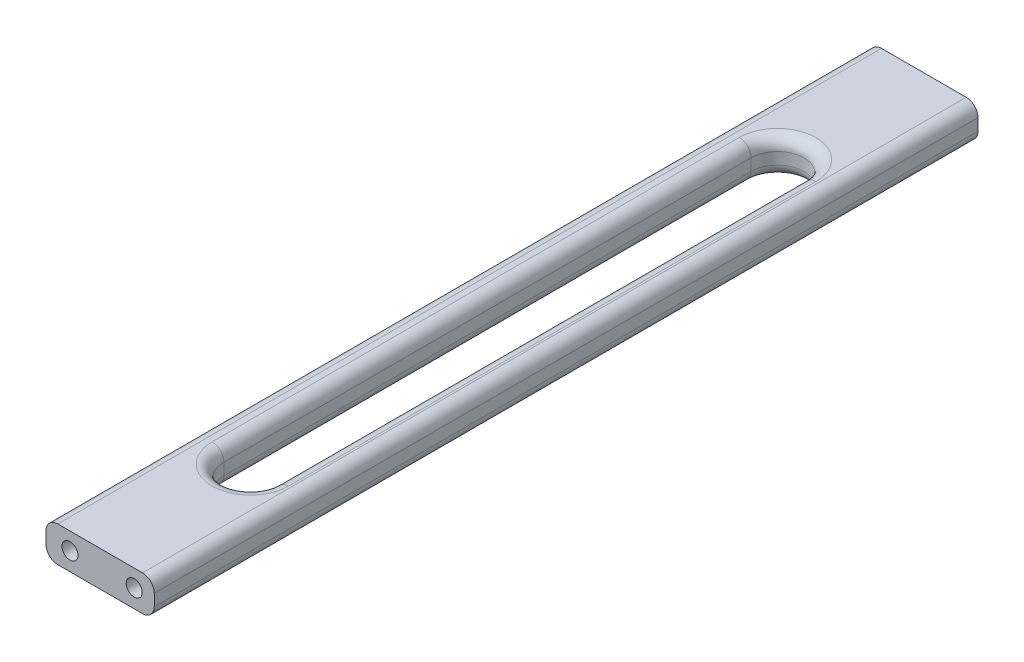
ISO-10303-21;
HEADER;
FILE_DESCRIPTION(('STEP AP214'),'2;1');
FILE_NAME('part.step','',(''),(''),'','','');
FILE_SCHEMA(('AUTOMOTIVE_DESIGN { 1 0 10303 214 1 1 1 1 }'));
ENDSEC;
DATA;
#1=APPLICATION_CONTEXT('core data for automotive mechanical design processes');
#2=APPLICATION_PROTOCOL_DEFINITION('international standard','automotive_design',2000,#1);
#3=PRODUCT_CONTEXT('',#1,'mechanical');
#4=PRODUCT('Part','Part','',(#3));
#5=PRODUCT_RELATED_PRODUCT_CATEGORY('part','',(#4));
#6=PRODUCT_DEFINITION_FORMATION('','',#4);
#7=PRODUCT_DEFINITION_CONTEXT('part definition',#1,'design');
#8=PRODUCT_DEFINITION('design','',#6,#7);
#9=PRODUCT_DEFINITION_SHAPE('','',#8);
#10=(LENGTH_UNIT() NAMED_UNIT(*) SI_UNIT(.MILLI.,.METRE.));
#11=(NAMED_UNIT(*) PLANE_ANGLE_UNIT() SI_UNIT($,.RADIAN.));
#12=(NAMED_UNIT(*) SI_UNIT($,.STERADIAN.) SOLID_ANGLE_UNIT());
#13=UNCERTAINTY_MEASURE_WITH_UNIT(LENGTH_MEASURE(1.E-05),#10,'distance_accuracy_value','');
#14=(GEOMETRIC_REPRESENTATION_CONTEXT(3) GLOBAL_UNCERTAINTY_ASSIGNED_CONTEXT((#13)) GLOBAL_UNIT_ASSIGNED_CONTEXT((#10,
#11,#12)) REPRESENTATION_CONTEXT('',''));
#15=CARTESIAN_POINT('',(0.,0.,0.));
#16=DIRECTION('',(0.,0.,1.));
#17=DIRECTION('',(1.,0.,0.));
#18=AXIS2_PLACEMENT_3D('',#15,#16,#17);
#19=CARTESIAN_POINT('',(-9.8370065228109,-28.9033608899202,177.8));
#20=DIRECTION('',(0.,-1.,0.));
#21=DIRECTION('',(0.,0.,-1.));
#22=AXIS2_PLACEMENT_3D('',#19,#20,#21);
#23=PLANE('',#22);
#24=DIRECTION('',(0.,0.,1.));
#25=VECTOR('',#24,1.);
#26=CARTESIAN_POINT('',(8.25499999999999,-28.9033608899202,177.8));
#27=LINE('',#26,#25);
#28=CARTESIAN_POINT('',(8.25500000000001,-28.9033608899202,32.004));
#29=VERTEX_POINT('',#28);
#30=CARTESIAN_POINT('',(8.25499999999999,-28.9033608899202,145.796));
#31=VERTEX_POINT('',#30);
#32=EDGE_CURVE('E220',#29,#31,#27,.T.);
#33=ORIENTED_EDGE('',*,*,#32,.T.);
#34=CARTESIAN_POINT('',(0.,-28.9033608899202,145.796));
#35=DIRECTION('',(0.,-1.,0.));
#36=DIRECTION('',(0.,0.,-1.));
#37=AXIS2_PLACEMENT_3D('',#34,#35,#36);
#38=CIRCLE('',#37,8.255);
#39=CARTESIAN_POINT('',(-8.255,-28.9033608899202,145.796));
#40=VERTEX_POINT('',#39);
#41=EDGE_CURVE('E226',#31,#40,#38,.T.);
#42=ORIENTED_EDGE('',*,*,#41,.T.);
#43=DIRECTION('',(0.,0.,-1.));
#44=VECTOR('',#43,1.);
#45=CARTESIAN_POINT('',(-8.25500000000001,-28.9033608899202,177.8));
#46=LINE('',#45,#44);
#47=CARTESIAN_POINT('',(-8.25499999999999,-28.9033608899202,32.004));
#48=VERTEX_POINT('',#47);
#49=EDGE_CURVE('E224',#40,#48,#46,.T.);
#50=ORIENTED_EDGE('',*,*,#49,.T.);
#51=CARTESIAN_POINT('',(0.,-28.9033608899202,32.004));
#52=DIRECTION('',(0.,-1.,0.));
#53=DIRECTION('',(0.,0.,-1.));
#54=AXIS2_PLACEMENT_3D('',#51,#52,#53);
#55=CIRCLE('',#54,8.255);
#56=EDGE_CURVE('E222',#48,#29,#55,.T.);
#57=ORIENTED_EDGE('',*,*,#56,.T.);
#58=EDGE_LOOP('',(#33,#42,#50,#57));
#59=FACE_BOUND('',#58,.T.);
#60=DIRECTION('',(-1.,0.,0.));
#61=VECTOR('',#60,1.);
#62=CARTESIAN_POINT('',(9.55291821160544,-28.9033608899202,177.8));
#63=LINE('',#62,#61);
#64=CARTESIAN_POINT('',(8.72445934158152,-28.9033608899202,177.8));
#65=VERTEX_POINT('',#64);
#66=CARTESIAN_POINT('',(-9.56354065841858,-28.9033608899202,177.8));
#67=VERTEX_POINT('',#66);
#68=EDGE_CURVE('E163',#65,#67,#63,.T.);
#69=ORIENTED_EDGE('',*,*,#68,.F.);
#70=DIRECTION('',(0.,0.,-1.));
#71=VECTOR('',#70,1.);
#72=CARTESIAN_POINT('',(8.72445934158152,-28.9033608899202,177.8));
#73=LINE('',#72,#71);
#74=CARTESIAN_POINT('',(8.72445934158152,-28.9033608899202,0.));
#75=VERTEX_POINT('',#74);
#76=EDGE_CURVE('E148',#65,#75,#73,.T.);
#77=ORIENTED_EDGE('',*,*,#76,.T.);
#78=DIRECTION('',(-1.,0.,0.));
#79=VECTOR('',#78,1.);
#80=CARTESIAN_POINT('',(-9.8370065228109,-28.9033608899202,0.));
#81=LINE('',#80,#79);
#82=CARTESIAN_POINT('',(-9.56354065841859,-28.9033608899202,0.));
#83=VERTEX_POINT('',#82);
#84=EDGE_CURVE('E160',#75,#83,#81,.T.);
#85=ORIENTED_EDGE('',*,*,#84,.T.);
#86=DIRECTION('',(0.,0.,-1.));
#87=VECTOR('',#86,1.);
#88=CARTESIAN_POINT('',(-9.56354065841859,-28.9033608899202,177.8));
#89=LINE('',#88,#87);
#90=EDGE_CURVE('E165',#83,#67,#89,.F.);
#91=ORIENTED_EDGE('',*,*,#90,.T.);
#92=EDGE_LOOP('',(#69,#77,#85,#91));
#93=FACE_BOUND('',#92,.T.);
#94=ADVANCED_FACE('F32',(#59,#93),#23,.F.);
#95=CARTESIAN_POINT('',(-12.1035406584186,-36.5233608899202,177.8));
#96=DIRECTION('',(1.,0.,0.));
#97=DIRECTION('',(0.,0.,-1.));
#98=AXIS2_PLACEMENT_3D('',#95,#96,#97);
#99=PLANE('',#98);
#100=DIRECTION('',(0.,-1.,0.));
#101=VECTOR('',#100,1.);
#102=CARTESIAN_POINT('',(-12.1035406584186,-36.5233608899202,177.8));
#103=LINE('',#102,#101);
#104=CARTESIAN_POINT('',(-12.1035406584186,-31.4433608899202,177.8));
#105=VERTEX_POINT('',#104);
#106=CARTESIAN_POINT('',(-12.1035406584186,-33.9833608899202,177.8));
#107=VERTEX_POINT('',#106);
#108=EDGE_CURVE('E185',#105,#107,#103,.T.);
#109=ORIENTED_EDGE('',*,*,#108,.F.);
#110=DIRECTION('',(0.,0.,-1.));
#111=VECTOR('',#110,1.);
#112=CARTESIAN_POINT('',(-12.1035406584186,-31.4433608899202,177.8));
#113=LINE('',#112,#111);
#114=CARTESIAN_POINT('',(-12.1035406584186,-31.4433608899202,0.));
#115=VERTEX_POINT('',#114);
#116=EDGE_CURVE('E212',#105,#115,#113,.T.);
#117=ORIENTED_EDGE('',*,*,#116,.T.);
#118=DIRECTION('',(0.,-1.,0.));
#119=VECTOR('',#118,1.);
#120=CARTESIAN_POINT('',(-12.1035406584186,-36.5233608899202,0.));
#121=LINE('',#120,#119);
#122=CARTESIAN_POINT('',(-12.1035406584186,-33.9833608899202,0.));
#123=VERTEX_POINT('',#122);
#124=EDGE_CURVE('E169',#115,#123,#121,.T.);
#125=ORIENTED_EDGE('',*,*,#124,.T.);
#126=DIRECTION('',(0.,0.,-1.));
#127=VECTOR('',#126,1.);
#128=CARTESIAN_POINT('',(-12.1035406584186,-33.9833608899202,177.8));
#129=LINE('',#128,#127);
#130=EDGE_CURVE('E210',#123,#107,#129,.F.);
#131=ORIENTED_EDGE('',*,*,#130,.T.);
#132=EDGE_LOOP('',(#109,#117,#125,#131));
#133=FACE_BOUND('',#132,.T.);
#134=ADVANCED_FACE('F344',(#133),#99,.F.);
#135=CARTESIAN_POINT('',(11.2644593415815,-36.5233608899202,177.8));
#136=DIRECTION('',(0.,1.,0.));
#137=DIRECTION('',(-1.,0.,0.));
#138=AXIS2_PLACEMENT_3D('',#135,#136,#137);
#139=PLANE('',#138);
#140=DIRECTION('',(0.,0.,1.));
#141=VECTOR('',#140,1.);
#142=CARTESIAN_POINT('',(-8.25500000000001,-36.5233608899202,177.8));
#143=LINE('',#142,#141);
#144=CARTESIAN_POINT('',(-8.25499999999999,-36.5233608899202,32.004));
#145=VERTEX_POINT('',#144);
#146=CARTESIAN_POINT('',(-8.255,-36.5233608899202,145.796));
#147=VERTEX_POINT('',#146);
#148=EDGE_CURVE('E239',#145,#147,#143,.T.);
#149=ORIENTED_EDGE('',*,*,#148,.T.);
#150=CARTESIAN_POINT('',(0.,-36.5233608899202,145.796));
#151=DIRECTION('',(0.,1.,0.));
#152=DIRECTION('',(-1.,0.,0.));
#153=AXIS2_PLACEMENT_3D('',#150,#151,#152);
#154=CIRCLE('',#153,8.255);
#155=CARTESIAN_POINT('',(8.255,-36.5233608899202,145.796));
#156=VERTEX_POINT('',#155);
#157=EDGE_CURVE('E241',#147,#156,#154,.T.);
#158=ORIENTED_EDGE('',*,*,#157,.T.);
#159=DIRECTION('',(0.,0.,-1.));
#160=VECTOR('',#159,1.);
#161=CARTESIAN_POINT('',(8.25499999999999,-36.5233608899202,177.8));
#162=LINE('',#161,#160);
#163=CARTESIAN_POINT('',(8.25500000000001,-36.5233608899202,32.004));
#164=VERTEX_POINT('',#163);
#165=EDGE_CURVE('E235',#156,#164,#162,.T.);
#166=ORIENTED_EDGE('',*,*,#165,.T.);
#167=CARTESIAN_POINT('',(0.,-36.5233608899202,32.004));
#168=DIRECTION('',(0.,1.,0.));
#169=DIRECTION('',(-1.,0.,0.));
#170=AXIS2_PLACEMENT_3D('',#167,#168,#169);
#171=CIRCLE('',#170,8.255);
#172=EDGE_CURVE('E237',#164,#145,#171,.T.);
#173=ORIENTED_EDGE('',*,*,#172,.T.);
#174=EDGE_LOOP('',(#149,#158,#166,#173));
#175=FACE_BOUND('',#174,.T.);
#176=DIRECTION('',(1.,0.,0.));
#177=VECTOR('',#176,1.);
#178=CARTESIAN_POINT('',(11.2644593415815,-36.5233608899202,0.));
#179=LINE('',#178,#177);
#180=CARTESIAN_POINT('',(-9.56354065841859,-36.5233608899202,0.));
#181=VERTEX_POINT('',#180);
#182=CARTESIAN_POINT('',(8.72445934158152,-36.5233608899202,0.));
#183=VERTEX_POINT('',#182);
#184=EDGE_CURVE('E173',#181,#183,#179,.T.);
#185=ORIENTED_EDGE('',*,*,#184,.T.);
#186=DIRECTION('',(0.,0.,-1.));
#187=VECTOR('',#186,1.);
#188=CARTESIAN_POINT('',(8.72445934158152,-36.5233608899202,177.8));
#189=LINE('',#188,#187);
#190=CARTESIAN_POINT('',(8.72445934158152,-36.5233608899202,177.8));
#191=VERTEX_POINT('',#190);
#192=EDGE_CURVE('E218',#183,#191,#189,.F.);
#193=ORIENTED_EDGE('',*,*,#192,.T.);
#194=DIRECTION('',(1.,0.,0.));
#195=VECTOR('',#194,1.);
#196=CARTESIAN_POINT('',(11.2644593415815,-36.5233608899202,177.8));
#197=LINE('',#196,#195);
#198=CARTESIAN_POINT('',(-9.56354065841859,-36.5233608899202,177.8));
#199=VERTEX_POINT('',#198);
#200=EDGE_CURVE('E188',#199,#191,#197,.T.);
#201=ORIENTED_EDGE('',*,*,#200,.F.);
#202=DIRECTION('',(0.,0.,-1.));
#203=VECTOR('',#202,1.);
#204=CARTESIAN_POINT('',(-9.56354065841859,-36.5233608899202,177.8));
#205=LINE('',#204,#203);
#206=EDGE_CURVE('E215',#199,#181,#205,.T.);
#207=ORIENTED_EDGE('',*,*,#206,.T.);
#208=EDGE_LOOP('',(#185,#193,#201,#207));
#209=FACE_BOUND('',#208,.T.);
#210=ADVANCED_FACE('F335',(#175,#209),#139,.F.);
#211=CARTESIAN_POINT('',(11.2644593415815,-36.5233608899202,177.8));
#212=DIRECTION('',(-1.,0.,0.));
#213=DIRECTION('',(0.,-1.,0.));
#214=AXIS2_PLACEMENT_3D('',#211,#212,#213);
#215=PLANE('',#214);
#216=DIRECTION('',(0.,1.,0.));
#217=VECTOR('',#216,1.);
#218=CARTESIAN_POINT('',(11.2644593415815,-36.5233608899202,0.));
#219=LINE('',#218,#217);
#220=CARTESIAN_POINT('',(11.2644593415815,-33.9833608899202,0.));
#221=VERTEX_POINT('',#220);
#222=CARTESIAN_POINT('',(11.2644593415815,-31.4433608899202,0.));
#223=VERTEX_POINT('',#222);
#224=EDGE_CURVE('E182',#221,#223,#219,.T.);
#225=ORIENTED_EDGE('',*,*,#224,.T.);
#226=DIRECTION('',(0.,0.,-1.));
#227=VECTOR('',#226,1.);
#228=CARTESIAN_POINT('',(11.2644593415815,-31.4433608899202,177.8));
#229=LINE('',#228,#227);
#230=CARTESIAN_POINT('',(11.2644593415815,-31.4433608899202,177.8));
#231=VERTEX_POINT('',#230);
#232=EDGE_CURVE('E149',#223,#231,#229,.F.);
#233=ORIENTED_EDGE('',*,*,#232,.T.);
#234=DIRECTION('',(0.,1.,0.));
#235=VECTOR('',#234,1.);
#236=CARTESIAN_POINT('',(11.2644593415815,-36.5233608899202,177.8));
#237=LINE('',#236,#235);
#238=CARTESIAN_POINT('',(11.2644593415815,-33.9833608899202,177.8));
#239=VERTEX_POINT('',#238);
#240=EDGE_CURVE('E191',#239,#231,#237,.T.);
#241=ORIENTED_EDGE('',*,*,#240,.F.);
#242=DIRECTION('',(0.,0.,-1.));
#243=VECTOR('',#242,1.);
#244=CARTESIAN_POINT('',(11.2644593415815,-33.9833608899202,177.8));
#245=LINE('',#244,#243);
#246=EDGE_CURVE('E154',#239,#221,#245,.T.);
#247=ORIENTED_EDGE('',*,*,#246,.T.);
#248=EDGE_LOOP('',(#225,#233,#241,#247));
#249=FACE_BOUND('',#248,.T.);
#250=ADVANCED_FACE('F323',(#249),#215,.F.);
#251=CARTESIAN_POINT('',(-12.1035406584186,-28.9033608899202,177.8));
#252=DIRECTION('',(0.,0.,1.));
#253=DIRECTION('',(1.,0.,0.));
#254=AXIS2_PLACEMENT_3D('',#251,#252,#253);
#255=PLANE('',#254);
#256=CARTESIAN_POINT('',(-6.93125599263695,-32.6089956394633,177.8));
#257=DIRECTION('',(0.,0.,1.));
#258=DIRECTION('',(-1.,0.,0.));
#259=AXIS2_PLACEMENT_3D('',#256,#257,#258);
#260=CIRCLE('',#259,1.7272);
#261=CARTESIAN_POINT('',(-8.65845599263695,-32.6089956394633,177.8));
#262=VERTEX_POINT('',#261);
#263=EDGE_CURVE('E310',#262,#262,#260,.T.);
#264=ORIENTED_EDGE('',*,*,#263,.F.);
#265=EDGE_LOOP('',(#264));
#266=FACE_BOUND('',#265,.T.);
#267=CARTESIAN_POINT('',(6.93125599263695,-32.6089956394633,177.8));
#268=DIRECTION('',(0.,0.,1.));
#269=DIRECTION('',(1.,0.,0.));
#270=AXIS2_PLACEMENT_3D('',#267,#268,#269);
#271=CIRCLE('',#270,1.7272);
#272=CARTESIAN_POINT('',(8.65845599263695,-32.6089956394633,177.8));
#273=VERTEX_POINT('',#272);
#274=EDGE_CURVE('E176',#273,#273,#271,.T.);
#275=ORIENTED_EDGE('',*,*,#274,.F.);
#276=EDGE_LOOP('',(#275));
#277=FACE_BOUND('',#276,.T.);
#278=ORIENTED_EDGE('',*,*,#240,.T.);
#279=CARTESIAN_POINT('',(8.72445934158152,-31.4433608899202,177.8));
#280=DIRECTION('',(0.,0.,1.));
#281=DIRECTION('',(1.,0.,0.));
#282=AXIS2_PLACEMENT_3D('',#279,#280,#281);
#283=CIRCLE('',#282,2.54);
#284=EDGE_CURVE('E208',#231,#65,#283,.T.);
#285=ORIENTED_EDGE('',*,*,#284,.T.);
#286=ORIENTED_EDGE('',*,*,#68,.T.);
#287=CARTESIAN_POINT('',(-9.56354065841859,-31.4433608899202,177.8));
#288=DIRECTION('',(0.,0.,1.));
#289=DIRECTION('',(1.,0.,0.));
#290=AXIS2_PLACEMENT_3D('',#287,#288,#289);
#291=CIRCLE('',#290,2.54);
#292=EDGE_CURVE('E206',#67,#105,#291,.T.);
#293=ORIENTED_EDGE('',*,*,#292,.T.);
#294=ORIENTED_EDGE('',*,*,#108,.T.);
#295=CARTESIAN_POINT('',(-9.56354065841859,-33.9833608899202,177.8));
#296=DIRECTION('',(0.,0.,1.));
#297=DIRECTION('',(1.,0.,0.));
#298=AXIS2_PLACEMENT_3D('',#295,#296,#297);
#299=CIRCLE('',#298,2.54);
#300=EDGE_CURVE('E202',#107,#199,#299,.T.);
#301=ORIENTED_EDGE('',*,*,#300,.T.);
#302=ORIENTED_EDGE('',*,*,#200,.T.);
#303=CARTESIAN_POINT('',(8.72445934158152,-33.9833608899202,177.8));
#304=DIRECTION('',(0.,0.,1.));
#305=DIRECTION('',(1.,0.,0.));
#306=AXIS2_PLACEMENT_3D('',#303,#304,#305);
#307=CIRCLE('',#306,2.54);
#308=EDGE_CURVE('E204',#191,#239,#307,.T.);
#309=ORIENTED_EDGE('',*,*,#308,.T.);
#310=EDGE_LOOP('',(#278,#285,#286,#293,#294,#301,#302,#309));
#311=FACE_BOUND('',#310,.T.);
#312=ADVANCED_FACE('F320',(#266,#277,#311),#255,.T.);
#313=CARTESIAN_POINT('',(-12.1035406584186,-28.9033608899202,0.));
#314=DIRECTION('',(0.,0.,1.));
#315=DIRECTION('',(1.,0.,0.));
#316=AXIS2_PLACEMENT_3D('',#313,#314,#315);
#317=PLANE('',#316);
#318=CARTESIAN_POINT('',(6.93125599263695,-32.6089956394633,0.));
#319=DIRECTION('',(0.,0.,-1.));
#320=DIRECTION('',(1.,0.,0.));
#321=AXIS2_PLACEMENT_3D('',#318,#319,#320);
#322=CIRCLE('',#321,1.7272);
#323=CARTESIAN_POINT('',(8.65845599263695,-32.6089956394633,0.));
#324=VERTEX_POINT('',#323);
#325=EDGE_CURVE('E296',#324,#324,#322,.T.);
#326=ORIENTED_EDGE('',*,*,#325,.F.);
#327=EDGE_LOOP('',(#326));
#328=FACE_BOUND('',#327,.T.);
#329=CARTESIAN_POINT('',(-6.93125599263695,-32.6089956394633,0.));
#330=DIRECTION('',(0.,0.,-1.));
#331=DIRECTION('',(-1.,0.,0.));
#332=AXIS2_PLACEMENT_3D('',#329,#330,#331);
#333=CIRCLE('',#332,1.7272);
#334=CARTESIAN_POINT('',(-8.65845599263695,-32.6089956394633,0.));
#335=VERTEX_POINT('',#334);
#336=EDGE_CURVE('E304',#335,#335,#333,.T.);
#337=ORIENTED_EDGE('',*,*,#336,.F.);
#338=EDGE_LOOP('',(#337));
#339=FACE_BOUND('',#338,.T.);
#340=ORIENTED_EDGE('',*,*,#84,.F.);
#341=CARTESIAN_POINT('',(8.72445934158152,-31.4433608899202,0.));
#342=DIRECTION('',(0.,0.,1.));
#343=DIRECTION('',(1.,0.,0.));
#344=AXIS2_PLACEMENT_3D('',#341,#342,#343);
#345=CIRCLE('',#344,2.54);
#346=EDGE_CURVE('E144',#75,#223,#345,.F.);
#347=ORIENTED_EDGE('',*,*,#346,.T.);
#348=ORIENTED_EDGE('',*,*,#224,.F.);
#349=CARTESIAN_POINT('',(8.72445934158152,-33.9833608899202,0.));
#350=DIRECTION('',(0.,0.,1.));
#351=DIRECTION('',(1.,0.,0.));
#352=AXIS2_PLACEMENT_3D('',#349,#350,#351);
#353=CIRCLE('',#352,2.54);
#354=EDGE_CURVE('E196',#221,#183,#353,.F.);
#355=ORIENTED_EDGE('',*,*,#354,.T.);
#356=ORIENTED_EDGE('',*,*,#184,.F.);
#357=CARTESIAN_POINT('',(-9.56354065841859,-33.9833608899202,0.));
#358=DIRECTION('',(0.,0.,1.));
#359=DIRECTION('',(1.,0.,0.));
#360=AXIS2_PLACEMENT_3D('',#357,#358,#359);
#361=CIRCLE('',#360,2.54);
#362=EDGE_CURVE('E164',#181,#123,#361,.F.);
#363=ORIENTED_EDGE('',*,*,#362,.T.);
#364=ORIENTED_EDGE('',*,*,#124,.F.);
#365=CARTESIAN_POINT('',(-9.56354065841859,-31.4433608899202,0.));
#366=DIRECTION('',(0.,0.,1.));
#367=DIRECTION('',(1.,0.,0.));
#368=AXIS2_PLACEMENT_3D('',#365,#366,#367);
#369=CIRCLE('',#368,2.54);
#370=EDGE_CURVE('E155',#115,#83,#369,.F.);
#371=ORIENTED_EDGE('',*,*,#370,.T.);
#372=EDGE_LOOP('',(#340,#347,#348,#355,#356,#363,#364,#371));
#373=FACE_BOUND('',#372,.T.);
#374=ADVANCED_FACE('F167',(#328,#339,#373),#317,.F.);
#375=CARTESIAN_POINT('',(6.93125599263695,-32.6089956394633,161.925));
#376=DIRECTION('',(0.,0.,1.));
#377=DIRECTION('',(1.,0.,0.));
#378=AXIS2_PLACEMENT_3D('',#375,#376,#377);
#379=CYLINDRICAL_SURFACE('',#378,1.7272);
#380=CARTESIAN_POINT('',(6.93125599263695,-32.6089956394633,161.925));
#381=DIRECTION('',(0.,0.,1.));
#382=DIRECTION('',(1.,0.,0.));
#383=AXIS2_PLACEMENT_3D('',#380,#381,#382);
#384=CIRCLE('',#383,1.7272);
#385=CARTESIAN_POINT('',(8.65845599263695,-32.6089956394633,161.925));
#386=VERTEX_POINT('',#385);
#387=EDGE_CURVE('E170',#386,#386,#384,.T.);
#388=ORIENTED_EDGE('',*,*,#387,.F.);
#389=EDGE_LOOP('',(#388));
#390=FACE_BOUND('',#389,.T.);
#391=ORIENTED_EDGE('',*,*,#274,.T.);
#392=EDGE_LOOP('',(#391));
#393=FACE_BOUND('',#392,.T.);
#394=ADVANCED_FACE('F318',(#390,#393),#379,.F.);
#395=CARTESIAN_POINT('',(6.93125599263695,-32.6089956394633,161.925));
#396=DIRECTION('',(0.,0.,1.));
#397=DIRECTION('',(1.,0.,0.));
#398=AXIS2_PLACEMENT_3D('',#395,#396,#397);
#399=PLANE('',#398);
#400=ORIENTED_EDGE('',*,*,#387,.T.);
#401=EDGE_LOOP('',(#400));
#402=FACE_BOUND('',#401,.T.);
#403=ADVANCED_FACE('F405',(#402),#399,.T.);
#404=CARTESIAN_POINT('',(-6.93125599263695,-32.6089956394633,161.925));
#405=DIRECTION('',(0.,0.,1.));
#406=DIRECTION('',(1.,0.,0.));
#407=AXIS2_PLACEMENT_3D('',#404,#405,#406);
#408=CYLINDRICAL_SURFACE('',#407,1.7272);
#409=CARTESIAN_POINT('',(-6.93125599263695,-32.6089956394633,161.925));
#410=DIRECTION('',(0.,0.,1.));
#411=DIRECTION('',(-1.,0.,0.));
#412=AXIS2_PLACEMENT_3D('',#409,#410,#411);
#413=CIRCLE('',#412,1.7272);
#414=CARTESIAN_POINT('',(-8.65845599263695,-32.6089956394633,161.925));
#415=VERTEX_POINT('',#414);
#416=EDGE_CURVE('E313',#415,#415,#413,.T.);
#417=ORIENTED_EDGE('',*,*,#416,.F.);
#418=EDGE_LOOP('',(#417));
#419=FACE_BOUND('',#418,.T.);
#420=ORIENTED_EDGE('',*,*,#263,.T.);
#421=EDGE_LOOP('',(#420));
#422=FACE_BOUND('',#421,.T.);
#423=ADVANCED_FACE('F409',(#419,#422),#408,.F.);
#424=CARTESIAN_POINT('',(-6.93125599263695,-32.6089956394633,161.925));
#425=DIRECTION('',(0.,0.,-1.));
#426=DIRECTION('',(-1.,0.,0.));
#427=AXIS2_PLACEMENT_3D('',#424,#425,#426);
#428=PLANE('',#427);
#429=ORIENTED_EDGE('',*,*,#416,.T.);
#430=EDGE_LOOP('',(#429));
#431=FACE_BOUND('',#430,.T.);
#432=ADVANCED_FACE('F413',(#431),#428,.F.);
#433=CARTESIAN_POINT('',(-6.93125599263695,-32.6089956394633,15.875));
#434=DIRECTION('',(0.,0.,-1.));
#435=DIRECTION('',(-1.,0.,0.));
#436=AXIS2_PLACEMENT_3D('',#433,#434,#435);
#437=CYLINDRICAL_SURFACE('',#436,1.7272);
#438=CARTESIAN_POINT('',(-6.93125599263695,-32.6089956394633,15.875));
#439=DIRECTION('',(0.,0.,-1.));
#440=DIRECTION('',(-1.,0.,0.));
#441=AXIS2_PLACEMENT_3D('',#438,#439,#440);
#442=CIRCLE('',#441,1.7272);
#443=CARTESIAN_POINT('',(-8.65845599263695,-32.6089956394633,15.875));
#444=VERTEX_POINT('',#443);
#445=EDGE_CURVE('E307',#444,#444,#442,.T.);
#446=ORIENTED_EDGE('',*,*,#445,.F.);
#447=EDGE_LOOP('',(#446));
#448=FACE_BOUND('',#447,.T.);
#449=ORIENTED_EDGE('',*,*,#336,.T.);
#450=EDGE_LOOP('',(#449));
#451=FACE_BOUND('',#450,.T.);
#452=ADVANCED_FACE('F417',(#448,#451),#437,.F.);
#453=CARTESIAN_POINT('',(-6.93125599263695,-32.6089956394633,15.875));
#454=DIRECTION('',(0.,0.,-1.));
#455=DIRECTION('',(-1.,0.,0.));
#456=AXIS2_PLACEMENT_3D('',#453,#454,#455);
#457=PLANE('',#456);
#458=ORIENTED_EDGE('',*,*,#445,.T.);
#459=EDGE_LOOP('',(#458));
#460=FACE_BOUND('',#459,.T.);
#461=ADVANCED_FACE('F421',(#460),#457,.T.);
#462=CARTESIAN_POINT('',(6.93125599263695,-32.6089956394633,15.875));
#463=DIRECTION('',(0.,0.,-1.));
#464=DIRECTION('',(-1.,0.,0.));
#465=AXIS2_PLACEMENT_3D('',#462,#463,#464);
#466=CYLINDRICAL_SURFACE('',#465,1.7272);
#467=CARTESIAN_POINT('',(6.93125599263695,-32.6089956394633,15.875));
#468=DIRECTION('',(0.,0.,-1.));
#469=DIRECTION('',(1.,0.,0.));
#470=AXIS2_PLACEMENT_3D('',#467,#468,#469);
#471=CIRCLE('',#470,1.7272);
#472=CARTESIAN_POINT('',(8.65845599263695,-32.6089956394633,15.875));
#473=VERTEX_POINT('',#472);
#474=EDGE_CURVE('E301',#473,#473,#471,.T.);
#475=ORIENTED_EDGE('',*,*,#474,.F.);
#476=EDGE_LOOP('',(#475));
#477=FACE_BOUND('',#476,.T.);
#478=ORIENTED_EDGE('',*,*,#325,.T.);
#479=EDGE_LOOP('',(#478));
#480=FACE_BOUND('',#479,.T.);
#481=ADVANCED_FACE('F425',(#477,#480),#466,.F.);
#482=CARTESIAN_POINT('',(6.93125599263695,-32.6089956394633,15.875));
#483=DIRECTION('',(0.,0.,1.));
#484=DIRECTION('',(1.,0.,0.));
#485=AXIS2_PLACEMENT_3D('',#482,#483,#484);
#486=PLANE('',#485);
#487=ORIENTED_EDGE('',*,*,#474,.T.);
#488=EDGE_LOOP('',(#487));
#489=FACE_BOUND('',#488,.T.);
#490=ADVANCED_FACE('F356',(#489),#486,.F.);
#491=CARTESIAN_POINT('',(8.72445934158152,-31.4433608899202,177.8));
#492=DIRECTION('',(0.,0.,-1.));
#493=DIRECTION('',(-1.,0.,0.));
#494=AXIS2_PLACEMENT_3D('',#491,#492,#493);
#495=CYLINDRICAL_SURFACE('',#494,2.54);
#496=ORIENTED_EDGE('',*,*,#284,.F.);
#497=ORIENTED_EDGE('',*,*,#232,.F.);
#498=ORIENTED_EDGE('',*,*,#346,.F.);
#499=ORIENTED_EDGE('',*,*,#76,.F.);
#500=EDGE_LOOP('',(#496,#497,#498,#499));
#501=FACE_BOUND('',#500,.T.);
#502=ADVANCED_FACE('F147',(#501),#495,.T.);
#503=CARTESIAN_POINT('',(-9.56354065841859,-31.4433608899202,177.8));
#504=DIRECTION('',(0.,0.,-1.));
#505=DIRECTION('',(-1.,0.,0.));
#506=AXIS2_PLACEMENT_3D('',#503,#504,#505);
#507=CYLINDRICAL_SURFACE('',#506,2.54);
#508=ORIENTED_EDGE('',*,*,#292,.F.);
#509=ORIENTED_EDGE('',*,*,#90,.F.);
#510=ORIENTED_EDGE('',*,*,#370,.F.);
#511=ORIENTED_EDGE('',*,*,#116,.F.);
#512=EDGE_LOOP('',(#508,#509,#510,#511));
#513=FACE_BOUND('',#512,.T.);
#514=ADVANCED_FACE('F348',(#513),#507,.T.);
#515=CARTESIAN_POINT('',(8.72445934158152,-33.9833608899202,177.8));
#516=DIRECTION('',(0.,0.,-1.));
#517=DIRECTION('',(-1.,0.,0.));
#518=AXIS2_PLACEMENT_3D('',#515,#516,#517);
#519=CYLINDRICAL_SURFACE('',#518,2.54);
#520=ORIENTED_EDGE('',*,*,#308,.F.);
#521=ORIENTED_EDGE('',*,*,#192,.F.);
#522=ORIENTED_EDGE('',*,*,#354,.F.);
#523=ORIENTED_EDGE('',*,*,#246,.F.);
#524=EDGE_LOOP('',(#520,#521,#522,#523));
#525=FACE_BOUND('',#524,.T.);
#526=ADVANCED_FACE('F331',(#525),#519,.T.);
#527=CARTESIAN_POINT('',(-9.56354065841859,-33.9833608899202,177.8));
#528=DIRECTION('',(0.,0.,-1.));
#529=DIRECTION('',(-1.,0.,0.));
#530=AXIS2_PLACEMENT_3D('',#527,#528,#529);
#531=CYLINDRICAL_SURFACE('',#530,2.54);
#532=ORIENTED_EDGE('',*,*,#300,.F.);
#533=ORIENTED_EDGE('',*,*,#130,.F.);
#534=ORIENTED_EDGE('',*,*,#362,.F.);
#535=ORIENTED_EDGE('',*,*,#206,.F.);
#536=EDGE_LOOP('',(#532,#533,#534,#535));
#537=FACE_BOUND('',#536,.T.);
#538=ADVANCED_FACE('F340',(#537),#531,.T.);
#539=CARTESIAN_POINT('',(0.,-18.7433608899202,32.004));
#540=DIRECTION('',(0.,-1.,0.));
#541=DIRECTION('',(1.,0.,0.));
#542=AXIS2_PLACEMENT_3D('',#539,#540,#541);
#543=CYLINDRICAL_SURFACE('',#542,5.715);
#544=DIRECTION('',(0.,-1.,0.));
#545=VECTOR('',#544,1.);
#546=CARTESIAN_POINT('',(5.71500000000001,-18.7433608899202,32.004));
#547=LINE('',#546,#545);
#548=CARTESIAN_POINT('',(5.71500000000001,-31.4433608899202,32.004));
#549=VERTEX_POINT('',#548);
#550=CARTESIAN_POINT('',(5.71500000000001,-33.9833608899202,32.004));
#551=VERTEX_POINT('',#550);
#552=EDGE_CURVE('E254',#549,#551,#547,.T.);
#553=ORIENTED_EDGE('',*,*,#552,.F.);
#554=CARTESIAN_POINT('',(0.,-31.4433608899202,32.004));
#555=DIRECTION('',(0.,-1.,0.));
#556=DIRECTION('',(0.,0.,-1.));
#557=AXIS2_PLACEMENT_3D('',#554,#555,#556);
#558=CIRCLE('',#557,5.715);
#559=CARTESIAN_POINT('',(-5.71499999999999,-31.4433608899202,32.004));
#560=VERTEX_POINT('',#559);
#561=EDGE_CURVE('E249',#549,#560,#558,.F.);
#562=ORIENTED_EDGE('',*,*,#561,.T.);
#563=DIRECTION('',(0.,-1.,0.));
#564=VECTOR('',#563,1.);
#565=CARTESIAN_POINT('',(-5.71499999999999,-18.7433608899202,32.004));
#566=LINE('',#565,#564);
#567=CARTESIAN_POINT('',(-5.71499999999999,-33.9833608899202,32.004));
#568=VERTEX_POINT('',#567);
#569=EDGE_CURVE('E294',#560,#568,#566,.T.);
#570=ORIENTED_EDGE('',*,*,#569,.T.);
#571=CARTESIAN_POINT('',(0.,-33.9833608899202,32.004));
#572=DIRECTION('',(0.,1.,0.));
#573=DIRECTION('',(-1.,0.,0.));
#574=AXIS2_PLACEMENT_3D('',#571,#572,#573);
#575=CIRCLE('',#574,5.715);
#576=EDGE_CURVE('E46',#568,#551,#575,.F.);
#577=ORIENTED_EDGE('',*,*,#576,.T.);
#578=EDGE_LOOP('',(#553,#562,#570,#577));
#579=FACE_BOUND('',#578,.T.);
#580=ADVANCED_FACE('F382',(#579),#543,.F.);
#581=CARTESIAN_POINT('',(-5.71500000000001,-18.7433608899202,145.796));
#582=DIRECTION('',(-1.,0.,0.));
#583=DIRECTION('',(0.,-1.,0.));
#584=AXIS2_PLACEMENT_3D('',#581,#582,#583);
#585=PLANE('',#584);
#586=ORIENTED_EDGE('',*,*,#569,.F.);
#587=DIRECTION('',(0.,0.,-1.));
#588=VECTOR('',#587,1.);
#589=CARTESIAN_POINT('',(-5.715,-31.4433608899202,145.796));
#590=LINE('',#589,#588);
#591=CARTESIAN_POINT('',(-5.715,-31.4433608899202,145.796));
#592=VERTEX_POINT('',#591);
#593=EDGE_CURVE('E246',#560,#592,#590,.F.);
#594=ORIENTED_EDGE('',*,*,#593,.T.);
#595=DIRECTION('',(0.,-1.,0.));
#596=VECTOR('',#595,1.);
#597=CARTESIAN_POINT('',(-5.71500000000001,-18.7433608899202,145.796));
#598=LINE('',#597,#596);
#599=CARTESIAN_POINT('',(-5.715,-33.9833608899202,145.796));
#600=VERTEX_POINT('',#599);
#601=EDGE_CURVE('E265',#592,#600,#598,.T.);
#602=ORIENTED_EDGE('',*,*,#601,.T.);
#603=DIRECTION('',(0.,0.,1.));
#604=VECTOR('',#603,1.);
#605=CARTESIAN_POINT('',(-5.715,-33.9833608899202,145.796));
#606=LINE('',#605,#604);
#607=EDGE_CURVE('E244',#600,#568,#606,.F.);
#608=ORIENTED_EDGE('',*,*,#607,.T.);
#609=EDGE_LOOP('',(#586,#594,#602,#608));
#610=FACE_BOUND('',#609,.T.);
#611=ADVANCED_FACE('F384',(#610),#585,.F.);
#612=CARTESIAN_POINT('',(0.,-18.7433608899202,145.796));
#613=DIRECTION('',(0.,-1.,0.));
#614=DIRECTION('',(1.,0.,0.));
#615=AXIS2_PLACEMENT_3D('',#612,#613,#614);
#616=CYLINDRICAL_SURFACE('',#615,5.715);
#617=ORIENTED_EDGE('',*,*,#601,.F.);
#618=CARTESIAN_POINT('',(0.,-31.4433608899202,145.796));
#619=DIRECTION('',(0.,-1.,0.));
#620=DIRECTION('',(0.,0.,-1.));
#621=AXIS2_PLACEMENT_3D('',#618,#619,#620);
#622=CIRCLE('',#621,5.715);
#623=CARTESIAN_POINT('',(5.71500000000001,-31.4433608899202,145.796));
#624=VERTEX_POINT('',#623);
#625=EDGE_CURVE('E232',#592,#624,#622,.F.);
#626=ORIENTED_EDGE('',*,*,#625,.T.);
#627=DIRECTION('',(0.,-1.,0.));
#628=VECTOR('',#627,1.);
#629=CARTESIAN_POINT('',(5.71500000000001,-18.7433608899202,145.796));
#630=LINE('',#629,#628);
#631=CARTESIAN_POINT('',(5.71500000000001,-33.9833608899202,145.796));
#632=VERTEX_POINT('',#631);
#633=EDGE_CURVE('E253',#624,#632,#630,.T.);
#634=ORIENTED_EDGE('',*,*,#633,.T.);
#635=CARTESIAN_POINT('',(0.,-33.9833608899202,145.796));
#636=DIRECTION('',(0.,1.,0.));
#637=DIRECTION('',(-1.,0.,0.));
#638=AXIS2_PLACEMENT_3D('',#635,#636,#637);
#639=CIRCLE('',#638,5.715);
#640=EDGE_CURVE('E229',#632,#600,#639,.F.);
#641=ORIENTED_EDGE('',*,*,#640,.T.);
#642=EDGE_LOOP('',(#617,#626,#634,#641));
#643=FACE_BOUND('',#642,.T.);
#644=ADVANCED_FACE('F262',(#643),#616,.F.);
#645=CARTESIAN_POINT('',(5.71499999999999,-18.7433608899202,145.796));
#646=DIRECTION('',(1.,0.,0.));
#647=DIRECTION('',(0.,1.,0.));
#648=AXIS2_PLACEMENT_3D('',#645,#646,#647);
#649=PLANE('',#648);
#650=ORIENTED_EDGE('',*,*,#633,.F.);
#651=DIRECTION('',(0.,0.,1.));
#652=VECTOR('',#651,1.);
#653=CARTESIAN_POINT('',(5.71499999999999,-31.4433608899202,145.796));
#654=LINE('',#653,#652);
#655=EDGE_CURVE('E11',#624,#549,#654,.F.);
#656=ORIENTED_EDGE('',*,*,#655,.T.);
#657=ORIENTED_EDGE('',*,*,#552,.T.);
#658=DIRECTION('',(0.,0.,-1.));
#659=VECTOR('',#658,1.);
#660=CARTESIAN_POINT('',(5.715,-33.9833608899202,145.796));
#661=LINE('',#660,#659);
#662=EDGE_CURVE('E39',#551,#632,#661,.F.);
#663=ORIENTED_EDGE('',*,*,#662,.T.);
#664=EDGE_LOOP('',(#650,#656,#657,#663));
#665=FACE_BOUND('',#664,.T.);
#666=ADVANCED_FACE('F252',(#665),#649,.F.);
#667=CARTESIAN_POINT('',(0.,-31.4433608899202,32.004));
#668=DIRECTION('',(0.,-1.,0.));
#669=DIRECTION('',(0.,0.,-1.));
#670=AXIS2_PLACEMENT_3D('',#667,#668,#669);
#671=TOROIDAL_SURFACE('',#670,8.255,2.54);
#672=CARTESIAN_POINT('',(-8.25499999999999,-31.4433608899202,32.004));
#673=DIRECTION('',(0.,0.,1.));
#674=DIRECTION('',(1.,0.,0.));
#675=AXIS2_PLACEMENT_3D('',#672,#673,#674);
#676=CIRCLE('',#675,2.54);
#677=EDGE_CURVE('E288',#560,#48,#676,.T.);
#678=ORIENTED_EDGE('',*,*,#677,.F.);
#679=ORIENTED_EDGE('',*,*,#561,.F.);
#680=CARTESIAN_POINT('',(8.25500000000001,-31.4433608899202,32.004));
#681=DIRECTION('',(0.,0.,1.));
#682=DIRECTION('',(1.,0.,0.));
#683=AXIS2_PLACEMENT_3D('',#680,#681,#682);
#684=CIRCLE('',#683,2.54);
#685=EDGE_CURVE('E291',#29,#549,#684,.T.);
#686=ORIENTED_EDGE('',*,*,#685,.F.);
#687=ORIENTED_EDGE('',*,*,#56,.F.);
#688=EDGE_LOOP('',(#678,#679,#686,#687));
#689=FACE_BOUND('',#688,.T.);
#690=ADVANCED_FACE('F379',(#689),#671,.T.);
#691=CARTESIAN_POINT('',(8.25499999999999,-31.4433608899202,177.8));
#692=DIRECTION('',(0.,0.,1.));
#693=DIRECTION('',(1.,0.,0.));
#694=AXIS2_PLACEMENT_3D('',#691,#692,#693);
#695=CYLINDRICAL_SURFACE('',#694,2.54);
#696=ORIENTED_EDGE('',*,*,#685,.T.);
#697=ORIENTED_EDGE('',*,*,#655,.F.);
#698=CARTESIAN_POINT('',(8.25499999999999,-31.4433608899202,145.796));
#699=DIRECTION('',(0.,0.,1.));
#700=DIRECTION('',(1.,0.,0.));
#701=AXIS2_PLACEMENT_3D('',#698,#699,#700);
#702=CIRCLE('',#701,2.54);
#703=EDGE_CURVE('E286',#31,#624,#702,.T.);
#704=ORIENTED_EDGE('',*,*,#703,.F.);
#705=ORIENTED_EDGE('',*,*,#32,.F.);
#706=EDGE_LOOP('',(#696,#697,#704,#705));
#707=FACE_BOUND('',#706,.T.);
#708=ADVANCED_FACE('F369',(#707),#695,.T.);
#709=CARTESIAN_POINT('',(-8.25500000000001,-31.4433608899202,177.8));
#710=DIRECTION('',(0.,0.,-1.));
#711=DIRECTION('',(-1.,0.,0.));
#712=AXIS2_PLACEMENT_3D('',#709,#710,#711);
#713=CYLINDRICAL_SURFACE('',#712,2.54);
#714=ORIENTED_EDGE('',*,*,#677,.T.);
#715=ORIENTED_EDGE('',*,*,#49,.F.);
#716=CARTESIAN_POINT('',(-8.255,-31.4433608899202,145.796));
#717=DIRECTION('',(0.,0.,1.));
#718=DIRECTION('',(1.,0.,0.));
#719=AXIS2_PLACEMENT_3D('',#716,#717,#718);
#720=CIRCLE('',#719,2.54);
#721=EDGE_CURVE('E284',#592,#40,#720,.T.);
#722=ORIENTED_EDGE('',*,*,#721,.F.);
#723=ORIENTED_EDGE('',*,*,#593,.F.);
#724=EDGE_LOOP('',(#714,#715,#722,#723));
#725=FACE_BOUND('',#724,.T.);
#726=ADVANCED_FACE('F376',(#725),#713,.T.);
#727=CARTESIAN_POINT('',(0.,-31.4433608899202,145.796));
#728=DIRECTION('',(0.,-1.,0.));
#729=DIRECTION('',(0.,0.,-1.));
#730=AXIS2_PLACEMENT_3D('',#727,#728,#729);
#731=TOROIDAL_SURFACE('',#730,8.255,2.54);
#732=ORIENTED_EDGE('',*,*,#703,.T.);
#733=ORIENTED_EDGE('',*,*,#625,.F.);
#734=ORIENTED_EDGE('',*,*,#721,.T.);
#735=ORIENTED_EDGE('',*,*,#41,.F.);
#736=EDGE_LOOP('',(#732,#733,#734,#735));
#737=FACE_BOUND('',#736,.T.);
#738=ADVANCED_FACE('F371',(#737),#731,.T.);
#739=CARTESIAN_POINT('',(0.,-33.9833608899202,32.004));
#740=DIRECTION('',(0.,1.,0.));
#741=DIRECTION('',(-1.,0.,0.));
#742=AXIS2_PLACEMENT_3D('',#739,#740,#741);
#743=TOROIDAL_SURFACE('',#742,8.255,2.54);
#744=CARTESIAN_POINT('',(8.25500000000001,-33.9833608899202,32.004));
#745=DIRECTION('',(0.,0.,1.));
#746=DIRECTION('',(1.,0.,0.));
#747=AXIS2_PLACEMENT_3D('',#744,#745,#746);
#748=CIRCLE('',#747,2.54);
#749=EDGE_CURVE('E277',#551,#164,#748,.T.);
#750=ORIENTED_EDGE('',*,*,#749,.F.);
#751=ORIENTED_EDGE('',*,*,#576,.F.);
#752=CARTESIAN_POINT('',(-8.25499999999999,-33.9833608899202,32.004));
#753=DIRECTION('',(0.,0.,1.));
#754=DIRECTION('',(1.,0.,0.));
#755=AXIS2_PLACEMENT_3D('',#752,#753,#754);
#756=CIRCLE('',#755,2.54);
#757=EDGE_CURVE('E281',#145,#568,#756,.T.);
#758=ORIENTED_EDGE('',*,*,#757,.F.);
#759=ORIENTED_EDGE('',*,*,#172,.F.);
#760=EDGE_LOOP('',(#750,#751,#758,#759));
#761=FACE_BOUND('',#760,.T.);
#762=ADVANCED_FACE('F391',(#761),#743,.T.);
#763=CARTESIAN_POINT('',(-8.25500000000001,-33.9833608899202,177.8));
#764=DIRECTION('',(0.,0.,1.));
#765=DIRECTION('',(1.,0.,0.));
#766=AXIS2_PLACEMENT_3D('',#763,#764,#765);
#767=CYLINDRICAL_SURFACE('',#766,2.54);
#768=ORIENTED_EDGE('',*,*,#757,.T.);
#769=ORIENTED_EDGE('',*,*,#607,.F.);
#770=CARTESIAN_POINT('',(-8.255,-33.9833608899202,145.796));
#771=DIRECTION('',(0.,0.,1.));
#772=DIRECTION('',(1.,0.,0.));
#773=AXIS2_PLACEMENT_3D('',#770,#771,#772);
#774=CIRCLE('',#773,2.54);
#775=EDGE_CURVE('E273',#147,#600,#774,.T.);
#776=ORIENTED_EDGE('',*,*,#775,.F.);
#777=ORIENTED_EDGE('',*,*,#148,.F.);
#778=EDGE_LOOP('',(#768,#769,#776,#777));
#779=FACE_BOUND('',#778,.T.);
#780=ADVANCED_FACE('F386',(#779),#767,.T.);
#781=CARTESIAN_POINT('',(8.25499999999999,-33.9833608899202,177.8));
#782=DIRECTION('',(0.,0.,-1.));
#783=DIRECTION('',(-1.,0.,0.));
#784=AXIS2_PLACEMENT_3D('',#781,#782,#783);
#785=CYLINDRICAL_SURFACE('',#784,2.54);
#786=ORIENTED_EDGE('',*,*,#749,.T.);
#787=ORIENTED_EDGE('',*,*,#165,.F.);
#788=CARTESIAN_POINT('',(8.255,-33.9833608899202,145.796));
#789=DIRECTION('',(0.,0.,1.));
#790=DIRECTION('',(1.,0.,0.));
#791=AXIS2_PLACEMENT_3D('',#788,#789,#790);
#792=CIRCLE('',#791,2.54);
#793=EDGE_CURVE('E270',#632,#156,#792,.T.);
#794=ORIENTED_EDGE('',*,*,#793,.F.);
#795=ORIENTED_EDGE('',*,*,#662,.F.);
#796=EDGE_LOOP('',(#786,#787,#794,#795));
#797=FACE_BOUND('',#796,.T.);
#798=ADVANCED_FACE('F275',(#797),#785,.T.);
#799=CARTESIAN_POINT('',(0.,-33.9833608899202,145.796));
#800=DIRECTION('',(0.,1.,0.));
#801=DIRECTION('',(-1.,0.,0.));
#802=AXIS2_PLACEMENT_3D('',#799,#800,#801);
#803=TOROIDAL_SURFACE('',#802,8.255,2.54);
#804=ORIENTED_EDGE('',*,*,#775,.T.);
#805=ORIENTED_EDGE('',*,*,#640,.F.);
#806=ORIENTED_EDGE('',*,*,#793,.T.);
#807=ORIENTED_EDGE('',*,*,#157,.F.);
#808=EDGE_LOOP('',(#804,#805,#806,#807));
#809=FACE_BOUND('',#808,.T.);
#810=ADVANCED_FACE('F268',(#809),#803,.T.);
#811=CLOSED_SHELL('',(#94,#134,#210,#250,#312,#374,#394,#403,#423,#432,#452,#461,#481,#490,#502,
#514,#526,#538,#580,#611,#644,#666,#690,#708,#726,#738,#762,#780,#798,#810));
#812=MANIFOLD_SOLID_BREP('B2',#811);
#813=ADVANCED_BREP_SHAPE_REPRESENTATION('',(#18,#812),#14);
#814=SHAPE_DEFINITION_REPRESENTATION(#9,#813);
ENDSEC;
END-ISO-10303-21;
